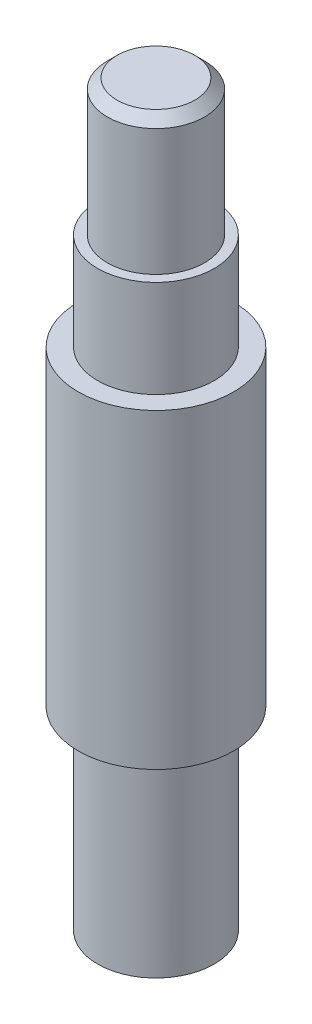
from build123d import *

# Parameters (mm, degrees)
SKETCH1_R      = 4
EXTRUDE1_DEPTH = 16
SKETCH2_R      = 3
EXTRUDE2_DEPTH = 10
EXTRUDE3_START = 5
SKETCH3_R      = 3
EXTRUDE3_DEPTH = 5
SKETCH4_R      = 2.5
EXTRUDE4_DEPTH = 7
CHAMFER1_SIZE  = 0.5


with BuildPart() as part:
    # Sketch1 → Extrude1 (new body)
    with BuildSketch(Plane(origin=(0, 0, 0), x_dir=(1, 0, 0), z_dir=(0, 1, 0))):
        with Locations(Location((0, 0, 0), (0, 0, 270))):
            Circle(SKETCH1_R)
    extrude(amount=EXTRUDE1_DEPTH)

    # Sketch2 → Extrude2 (add)
    with BuildSketch(Plane.XZ):
        with Locations(Location((0, 0, 0), (0, 0, 90))):
            Circle(SKETCH2_R)
    extrude(amount=EXTRUDE2_DEPTH)

    # Sketch3 → Extrude3 (add)
    with BuildSketch(Plane(origin=(0, 16, 0), x_dir=(1, 0, 0), z_dir=(0, 1, 0)).offset(EXTRUDE3_START)):
        with Locations(Location((0, 0, 0), (0, 0, 270))):
            Circle(SKETCH3_R)
    extrude(amount=-EXTRUDE3_DEPTH)

    # Sketch4 → Extrude4 (add)
    with BuildSketch(Plane(origin=(0, 21, 0), x_dir=(1, 0, 0), z_dir=(0, 1, 0))):
        with Locations(Location((0, 0, 0), (0, 0, 270))):
            Circle(SKETCH4_R)
    extrude(amount=EXTRUDE4_DEPTH)

    # Chamfer1
    chamfer1_edges = [part.edges().sort_by_distance(p)[0] for p in [
        (0, 28, -2.5),
    ]]
    chamfer(chamfer1_edges, length=CHAMFER1_SIZE)


solid = part.part
